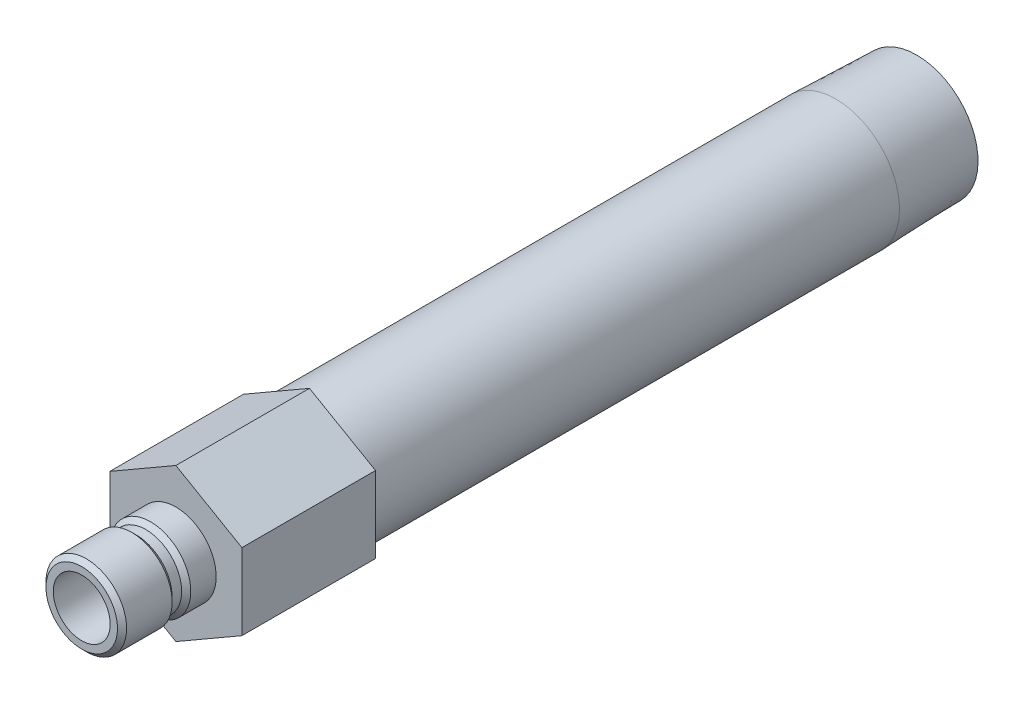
ISO-10303-21;
HEADER;
FILE_DESCRIPTION(('STEP AP214'),'2;1');
FILE_NAME('part.step','',(''),(''),'','','');
FILE_SCHEMA(('AUTOMOTIVE_DESIGN { 1 0 10303 214 1 1 1 1 }'));
ENDSEC;
DATA;
#1=APPLICATION_CONTEXT('core data for automotive mechanical design processes');
#2=APPLICATION_PROTOCOL_DEFINITION('international standard','automotive_design',2000,#1);
#3=PRODUCT_CONTEXT('',#1,'mechanical');
#4=PRODUCT('Part','Part','',(#3));
#5=PRODUCT_RELATED_PRODUCT_CATEGORY('part','',(#4));
#6=PRODUCT_DEFINITION_FORMATION('','',#4);
#7=PRODUCT_DEFINITION_CONTEXT('part definition',#1,'design');
#8=PRODUCT_DEFINITION('design','',#6,#7);
#9=PRODUCT_DEFINITION_SHAPE('','',#8);
#10=(LENGTH_UNIT() NAMED_UNIT(*) SI_UNIT(.MILLI.,.METRE.));
#11=(NAMED_UNIT(*) PLANE_ANGLE_UNIT() SI_UNIT($,.RADIAN.));
#12=(NAMED_UNIT(*) SI_UNIT($,.STERADIAN.) SOLID_ANGLE_UNIT());
#13=UNCERTAINTY_MEASURE_WITH_UNIT(LENGTH_MEASURE(1.E-05),#10,'distance_accuracy_value','');
#14=(GEOMETRIC_REPRESENTATION_CONTEXT(3) GLOBAL_UNCERTAINTY_ASSIGNED_CONTEXT((#13)) GLOBAL_UNIT_ASSIGNED_CONTEXT((#10,
#11,#12)) REPRESENTATION_CONTEXT('',''));
#15=CARTESIAN_POINT('',(0.,0.,0.));
#16=DIRECTION('',(0.,0.,1.));
#17=DIRECTION('',(1.,0.,0.));
#18=AXIS2_PLACEMENT_3D('',#15,#16,#17);
#19=CARTESIAN_POINT('',(0.,0.,0.));
#20=DIRECTION('',(0.,0.,-1.));
#21=DIRECTION('',(0.,1.,0.));
#22=AXIS2_PLACEMENT_3D('',#19,#20,#21);
#23=CYLINDRICAL_SURFACE('',#22,10.668);
#24=CARTESIAN_POINT('',(0.,0.,-110.3884));
#25=DIRECTION('',(0.,0.,-1.));
#26=DIRECTION('',(0.,1.,0.));
#27=AXIS2_PLACEMENT_3D('',#24,#25,#26);
#28=CIRCLE('',#27,10.668);
#29=CARTESIAN_POINT('',(0.,10.668,-110.3884));
#30=VERTEX_POINT('',#29);
#31=EDGE_CURVE('E168',#30,#30,#28,.T.);
#32=ORIENTED_EDGE('',*,*,#31,.F.);
#33=EDGE_LOOP('',(#32));
#34=FACE_BOUND('',#33,.T.);
#35=CARTESIAN_POINT('',(0.,0.,-22.352));
#36=DIRECTION('',(0.,0.,1.));
#37=DIRECTION('',(1.,0.,0.));
#38=AXIS2_PLACEMENT_3D('',#35,#36,#37);
#39=CIRCLE('',#38,10.668);
#40=CARTESIAN_POINT('',(10.668,0.,-22.352));
#41=VERTEX_POINT('',#40);
#42=EDGE_CURVE('E37',#41,#41,#39,.F.);
#43=ORIENTED_EDGE('',*,*,#42,.T.);
#44=EDGE_LOOP('',(#43));
#45=FACE_BOUND('',#44,.T.);
#46=ADVANCED_FACE('F33',(#34,#45),#23,.T.);
#47=CARTESIAN_POINT('',(0.,0.,0.));
#48=DIRECTION('',(0.,0.,-1.));
#49=DIRECTION('',(0.,1.,0.));
#50=AXIS2_PLACEMENT_3D('',#47,#48,#49);
#51=CYLINDRICAL_SURFACE('',#50,4.76249999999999);
#52=CARTESIAN_POINT('',(0.,0.,15.748));
#53=DIRECTION('',(0.,0.,-1.));
#54=DIRECTION('',(0.,1.,0.));
#55=AXIS2_PLACEMENT_3D('',#52,#53,#54);
#56=CIRCLE('',#55,4.7625);
#57=CARTESIAN_POINT('',(0.,4.7625,15.748));
#58=VERTEX_POINT('',#57);
#59=EDGE_CURVE('E144',#58,#58,#56,.T.);
#60=ORIENTED_EDGE('',*,*,#59,.F.);
#61=EDGE_LOOP('',(#60));
#62=FACE_BOUND('',#61,.T.);
#63=CARTESIAN_POINT('',(0.,0.,-22.352));
#64=DIRECTION('',(0.,0.,-1.));
#65=DIRECTION('',(0.,1.,0.));
#66=AXIS2_PLACEMENT_3D('',#63,#64,#65);
#67=CIRCLE('',#66,4.76249999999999);
#68=CARTESIAN_POINT('',(0.,4.7625,-22.352));
#69=VERTEX_POINT('',#68);
#70=EDGE_CURVE('E11',#69,#69,#67,.T.);
#71=ORIENTED_EDGE('',*,*,#70,.T.);
#72=EDGE_LOOP('',(#71));
#73=FACE_BOUND('',#72,.T.);
#74=ADVANCED_FACE('F35',(#62,#73),#51,.F.);
#75=CARTESIAN_POINT('',(0.,4.7625,-22.352));
#76=DIRECTION('',(0.,0.,-1.));
#77=DIRECTION('',(0.,1.,0.));
#78=AXIS2_PLACEMENT_3D('',#75,#76,#77);
#79=PLANE('',#78);
#80=CARTESIAN_POINT('',(0.,0.,-22.352));
#81=DIRECTION('',(0.,0.,-1.));
#82=DIRECTION('',(0.,1.,0.));
#83=AXIS2_PLACEMENT_3D('',#80,#81,#82);
#84=CIRCLE('',#83,7.89939999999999);
#85=CARTESIAN_POINT('',(0.,7.8994,-22.352));
#86=VERTEX_POINT('',#85);
#87=EDGE_CURVE('E43',#86,#86,#84,.T.);
#88=ORIENTED_EDGE('',*,*,#87,.T.);
#89=EDGE_LOOP('',(#88));
#90=FACE_BOUND('',#89,.T.);
#91=ORIENTED_EDGE('',*,*,#70,.F.);
#92=EDGE_LOOP('',(#91));
#93=FACE_BOUND('',#92,.T.);
#94=ADVANCED_FACE('F180',(#90,#93),#79,.T.);
#95=CARTESIAN_POINT('',(0.,0.,0.));
#96=DIRECTION('',(0.,0.,-1.));
#97=DIRECTION('',(0.,1.,0.));
#98=AXIS2_PLACEMENT_3D('',#95,#96,#97);
#99=CYLINDRICAL_SURFACE('',#98,7.89939999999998);
#100=CARTESIAN_POINT('',(0.,0.,-123.952));
#101=DIRECTION('',(0.,0.,-1.));
#102=DIRECTION('',(0.,1.,0.));
#103=AXIS2_PLACEMENT_3D('',#100,#101,#102);
#104=CIRCLE('',#103,7.89939999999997);
#105=CARTESIAN_POINT('',(0.,7.8994,-123.952));
#106=VERTEX_POINT('',#105);
#107=EDGE_CURVE('E174',#106,#106,#104,.T.);
#108=ORIENTED_EDGE('',*,*,#107,.T.);
#109=EDGE_LOOP('',(#108));
#110=FACE_BOUND('',#109,.T.);
#111=ORIENTED_EDGE('',*,*,#87,.F.);
#112=EDGE_LOOP('',(#111));
#113=FACE_BOUND('',#112,.T.);
#114=ADVANCED_FACE('F183',(#110,#113),#99,.F.);
#115=CARTESIAN_POINT('',(0.,10.244140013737,-123.952));
#116=DIRECTION('',(0.,0.,-1.));
#117=DIRECTION('',(0.,1.,0.));
#118=AXIS2_PLACEMENT_3D('',#115,#116,#117);
#119=PLANE('',#118);
#120=CARTESIAN_POINT('',(0.,0.,-123.952));
#121=DIRECTION('',(0.,0.,-1.));
#122=DIRECTION('',(0.,1.,0.));
#123=AXIS2_PLACEMENT_3D('',#120,#121,#122);
#124=CIRCLE('',#123,10.2441400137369);
#125=CARTESIAN_POINT('',(0.,10.244140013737,-123.952));
#126=VERTEX_POINT('',#125);
#127=EDGE_CURVE('E171',#126,#126,#124,.T.);
#128=ORIENTED_EDGE('',*,*,#127,.T.);
#129=EDGE_LOOP('',(#128));
#130=FACE_BOUND('',#129,.T.);
#131=ORIENTED_EDGE('',*,*,#107,.F.);
#132=EDGE_LOOP('',(#131));
#133=FACE_BOUND('',#132,.T.);
#134=ADVANCED_FACE('F185',(#130,#133),#119,.T.);
#135=CARTESIAN_POINT('',(0.,0.,-123.952));
#136=DIRECTION('',(0.,0.,1.));
#137=DIRECTION('',(0.,-1.,0.));
#138=AXIS2_PLACEMENT_3D('',#135,#136,#137);
#139=CONICAL_SURFACE('',#138,10.2441400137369,0.0312396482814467);
#140=ORIENTED_EDGE('',*,*,#31,.T.);
#141=EDGE_LOOP('',(#140));
#142=FACE_BOUND('',#141,.T.);
#143=ORIENTED_EDGE('',*,*,#127,.F.);
#144=EDGE_LOOP('',(#143));
#145=FACE_BOUND('',#144,.T.);
#146=ADVANCED_FACE('F192',(#142,#145),#139,.T.);
#147=CARTESIAN_POINT('',(0.,6.7437,0.));
#148=DIRECTION('',(0.,0.,1.));
#149=DIRECTION('',(0.,-1.,0.));
#150=AXIS2_PLACEMENT_3D('',#147,#148,#149);
#151=PLANE('',#150);
#152=CARTESIAN_POINT('',(0.,0.,0.));
#153=DIRECTION('',(0.,0.,-1.));
#154=DIRECTION('',(0.,1.,0.));
#155=AXIS2_PLACEMENT_3D('',#152,#153,#154);
#156=CIRCLE('',#155,6.7437);
#157=CARTESIAN_POINT('',(0.,6.7437,0.));
#158=VERTEX_POINT('',#157);
#159=EDGE_CURVE('E165',#158,#158,#156,.T.);
#160=ORIENTED_EDGE('',*,*,#159,.T.);
#161=EDGE_LOOP('',(#160));
#162=FACE_BOUND('',#161,.T.);
#163=DIRECTION('',(-0.866025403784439,-0.5,0.));
#164=VECTOR('',#163,1.);
#165=CARTESIAN_POINT('',(0.,12.7582862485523,0.));
#166=LINE('',#165,#164);
#167=CARTESIAN_POINT('',(0.,12.7582862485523,0.));
#168=VERTEX_POINT('',#167);
#169=CARTESIAN_POINT('',(-11.049,6.37914312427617,0.));
#170=VERTEX_POINT('',#169);
#171=EDGE_CURVE('E122',#168,#170,#166,.T.);
#172=ORIENTED_EDGE('',*,*,#171,.T.);
#173=DIRECTION('',(0.,-1.,0.));
#174=VECTOR('',#173,1.);
#175=CARTESIAN_POINT('',(-11.049,6.37914312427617,0.));
#176=LINE('',#175,#174);
#177=CARTESIAN_POINT('',(-11.049,-6.37914312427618,0.));
#178=VERTEX_POINT('',#177);
#179=EDGE_CURVE('E125',#170,#178,#176,.T.);
#180=ORIENTED_EDGE('',*,*,#179,.T.);
#181=DIRECTION('',(0.866025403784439,-0.5,0.));
#182=VECTOR('',#181,1.);
#183=CARTESIAN_POINT('',(-11.049,-6.37914312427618,0.));
#184=LINE('',#183,#182);
#185=CARTESIAN_POINT('',(0.,-12.7582862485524,0.));
#186=VERTEX_POINT('',#185);
#187=EDGE_CURVE('E128',#178,#186,#184,.T.);
#188=ORIENTED_EDGE('',*,*,#187,.T.);
#189=DIRECTION('',(0.866025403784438,0.5,0.));
#190=VECTOR('',#189,1.);
#191=CARTESIAN_POINT('',(0.,-12.7582862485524,0.));
#192=LINE('',#191,#190);
#193=CARTESIAN_POINT('',(11.049,-6.37914312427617,0.));
#194=VERTEX_POINT('',#193);
#195=EDGE_CURVE('E131',#186,#194,#192,.T.);
#196=ORIENTED_EDGE('',*,*,#195,.T.);
#197=DIRECTION('',(0.,1.,0.));
#198=VECTOR('',#197,1.);
#199=CARTESIAN_POINT('',(11.049,-6.37914312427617,0.));
#200=LINE('',#199,#198);
#201=CARTESIAN_POINT('',(11.049,6.37914312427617,0.));
#202=VERTEX_POINT('',#201);
#203=EDGE_CURVE('E99',#194,#202,#200,.T.);
#204=ORIENTED_EDGE('',*,*,#203,.T.);
#205=DIRECTION('',(-0.866025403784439,0.5,0.));
#206=VECTOR('',#205,1.);
#207=CARTESIAN_POINT('',(11.049,6.37914312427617,0.));
#208=LINE('',#207,#206);
#209=EDGE_CURVE('E134',#202,#168,#208,.T.);
#210=ORIENTED_EDGE('',*,*,#209,.T.);
#211=EDGE_LOOP('',(#172,#180,#188,#196,#204,#210));
#212=FACE_BOUND('',#211,.T.);
#213=ADVANCED_FACE('F206',(#162,#212),#151,.T.);
#214=CARTESIAN_POINT('',(0.,0.,0.));
#215=DIRECTION('',(0.,0.,-1.));
#216=DIRECTION('',(0.,1.,0.));
#217=AXIS2_PLACEMENT_3D('',#214,#215,#216);
#218=CYLINDRICAL_SURFACE('',#217,6.7437);
#219=CARTESIAN_POINT('',(0.,0.,4.25449999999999));
#220=DIRECTION('',(0.,0.,-1.));
#221=DIRECTION('',(0.,1.,0.));
#222=AXIS2_PLACEMENT_3D('',#219,#220,#221);
#223=CIRCLE('',#222,6.7437);
#224=CARTESIAN_POINT('',(0.,6.7437,4.25449999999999));
#225=VERTEX_POINT('',#224);
#226=EDGE_CURVE('E162',#225,#225,#223,.T.);
#227=ORIENTED_EDGE('',*,*,#226,.T.);
#228=EDGE_LOOP('',(#227));
#229=FACE_BOUND('',#228,.T.);
#230=ORIENTED_EDGE('',*,*,#159,.F.);
#231=EDGE_LOOP('',(#230));
#232=FACE_BOUND('',#231,.T.);
#233=ADVANCED_FACE('F213',(#229,#232),#218,.T.);
#234=CARTESIAN_POINT('',(0.,0.,4.25449999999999));
#235=DIRECTION('',(0.,0.,-1.));
#236=DIRECTION('',(0.,1.,0.));
#237=AXIS2_PLACEMENT_3D('',#234,#235,#236);
#238=CONICAL_SURFACE('',#237,6.7437,0.785398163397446);
#239=CARTESIAN_POINT('',(0.,0.,5.0165));
#240=DIRECTION('',(0.,0.,-1.));
#241=DIRECTION('',(0.,1.,0.));
#242=AXIS2_PLACEMENT_3D('',#239,#240,#241);
#243=CIRCLE('',#242,5.9817);
#244=CARTESIAN_POINT('',(0.,5.9817,5.0165));
#245=VERTEX_POINT('',#244);
#246=EDGE_CURVE('E159',#245,#245,#243,.T.);
#247=ORIENTED_EDGE('',*,*,#246,.T.);
#248=EDGE_LOOP('',(#247));
#249=FACE_BOUND('',#248,.T.);
#250=ORIENTED_EDGE('',*,*,#226,.F.);
#251=EDGE_LOOP('',(#250));
#252=FACE_BOUND('',#251,.T.);
#253=ADVANCED_FACE('F222',(#249,#252),#238,.T.);
#254=CARTESIAN_POINT('',(0.,0.,0.));
#255=DIRECTION('',(0.,0.,-1.));
#256=DIRECTION('',(0.,1.,0.));
#257=AXIS2_PLACEMENT_3D('',#254,#255,#256);
#258=CYLINDRICAL_SURFACE('',#257,5.9817);
#259=CARTESIAN_POINT('',(0.,0.,6.604));
#260=DIRECTION('',(0.,0.,-1.));
#261=DIRECTION('',(0.,1.,0.));
#262=AXIS2_PLACEMENT_3D('',#259,#260,#261);
#263=CIRCLE('',#262,5.9817);
#264=CARTESIAN_POINT('',(0.,5.9817,6.604));
#265=VERTEX_POINT('',#264);
#266=EDGE_CURVE('E156',#265,#265,#263,.T.);
#267=ORIENTED_EDGE('',*,*,#266,.T.);
#268=EDGE_LOOP('',(#267));
#269=FACE_BOUND('',#268,.T.);
#270=ORIENTED_EDGE('',*,*,#246,.F.);
#271=EDGE_LOOP('',(#270));
#272=FACE_BOUND('',#271,.T.);
#273=ADVANCED_FACE('F263',(#269,#272),#258,.T.);
#274=CARTESIAN_POINT('',(0.,0.,6.604));
#275=DIRECTION('',(0.,0.,1.));
#276=DIRECTION('',(0.,-1.,0.));
#277=AXIS2_PLACEMENT_3D('',#274,#275,#276);
#278=CONICAL_SURFACE('',#277,5.9817,0.785398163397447);
#279=CARTESIAN_POINT('',(0.,0.,7.366));
#280=DIRECTION('',(0.,0.,-1.));
#281=DIRECTION('',(0.,1.,0.));
#282=AXIS2_PLACEMENT_3D('',#279,#280,#281);
#283=CIRCLE('',#282,6.7437);
#284=CARTESIAN_POINT('',(0.,6.7437,7.366));
#285=VERTEX_POINT('',#284);
#286=EDGE_CURVE('E153',#285,#285,#283,.T.);
#287=ORIENTED_EDGE('',*,*,#286,.T.);
#288=EDGE_LOOP('',(#287));
#289=FACE_BOUND('',#288,.T.);
#290=ORIENTED_EDGE('',*,*,#266,.F.);
#291=EDGE_LOOP('',(#290));
#292=FACE_BOUND('',#291,.T.);
#293=ADVANCED_FACE('F259',(#289,#292),#278,.T.);
#294=CARTESIAN_POINT('',(0.,0.,0.));
#295=DIRECTION('',(0.,0.,-1.));
#296=DIRECTION('',(0.,1.,0.));
#297=AXIS2_PLACEMENT_3D('',#294,#295,#296);
#298=CYLINDRICAL_SURFACE('',#297,6.7437);
#299=CARTESIAN_POINT('',(0.,0.,14.986));
#300=DIRECTION('',(0.,0.,-1.));
#301=DIRECTION('',(0.,1.,0.));
#302=AXIS2_PLACEMENT_3D('',#299,#300,#301);
#303=CIRCLE('',#302,6.7437);
#304=CARTESIAN_POINT('',(0.,6.7437,14.986));
#305=VERTEX_POINT('',#304);
#306=EDGE_CURVE('E150',#305,#305,#303,.T.);
#307=ORIENTED_EDGE('',*,*,#306,.T.);
#308=EDGE_LOOP('',(#307));
#309=FACE_BOUND('',#308,.T.);
#310=ORIENTED_EDGE('',*,*,#286,.F.);
#311=EDGE_LOOP('',(#310));
#312=FACE_BOUND('',#311,.T.);
#313=ADVANCED_FACE('F255',(#309,#312),#298,.T.);
#314=CARTESIAN_POINT('',(0.,0.,14.986));
#315=DIRECTION('',(0.,0.,-1.));
#316=DIRECTION('',(0.,1.,0.));
#317=AXIS2_PLACEMENT_3D('',#314,#315,#316);
#318=CONICAL_SURFACE('',#317,6.7437,0.785398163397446);
#319=CARTESIAN_POINT('',(0.,0.,15.748));
#320=DIRECTION('',(0.,0.,-1.));
#321=DIRECTION('',(0.,1.,0.));
#322=AXIS2_PLACEMENT_3D('',#319,#320,#321);
#323=CIRCLE('',#322,5.9817);
#324=CARTESIAN_POINT('',(0.,5.9817,15.748));
#325=VERTEX_POINT('',#324);
#326=EDGE_CURVE('E147',#325,#325,#323,.T.);
#327=ORIENTED_EDGE('',*,*,#326,.T.);
#328=EDGE_LOOP('',(#327));
#329=FACE_BOUND('',#328,.T.);
#330=ORIENTED_EDGE('',*,*,#306,.F.);
#331=EDGE_LOOP('',(#330));
#332=FACE_BOUND('',#331,.T.);
#333=ADVANCED_FACE('F251',(#329,#332),#318,.T.);
#334=CARTESIAN_POINT('',(0.,4.7625,15.748));
#335=DIRECTION('',(0.,0.,1.));
#336=DIRECTION('',(0.,-1.,0.));
#337=AXIS2_PLACEMENT_3D('',#334,#335,#336);
#338=PLANE('',#337);
#339=ORIENTED_EDGE('',*,*,#59,.T.);
#340=EDGE_LOOP('',(#339));
#341=FACE_BOUND('',#340,.T.);
#342=ORIENTED_EDGE('',*,*,#326,.F.);
#343=EDGE_LOOP('',(#342));
#344=FACE_BOUND('',#343,.T.);
#345=ADVANCED_FACE('F239',(#341,#344),#338,.T.);
#346=CARTESIAN_POINT('',(0.,12.7582862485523,-22.352));
#347=DIRECTION('',(-0.5,0.866025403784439,0.));
#348=DIRECTION('',(-0.866025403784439,-0.5,0.));
#349=AXIS2_PLACEMENT_3D('',#346,#347,#348);
#350=PLANE('',#349);
#351=ORIENTED_EDGE('',*,*,#171,.F.);
#352=DIRECTION('',(0.,0.,1.));
#353=VECTOR('',#352,1.);
#354=CARTESIAN_POINT('',(0.,12.7582862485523,-22.352));
#355=LINE('',#354,#353);
#356=CARTESIAN_POINT('',(0.,12.7582862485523,-22.352));
#357=VERTEX_POINT('',#356);
#358=EDGE_CURVE('E51',#357,#168,#355,.T.);
#359=ORIENTED_EDGE('',*,*,#358,.F.);
#360=DIRECTION('',(-0.866025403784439,-0.5,0.));
#361=VECTOR('',#360,1.);
#362=CARTESIAN_POINT('',(0.,12.7582862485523,-22.352));
#363=LINE('',#362,#361);
#364=CARTESIAN_POINT('',(-11.049,6.37914312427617,-22.352));
#365=VERTEX_POINT('',#364);
#366=EDGE_CURVE('E137',#357,#365,#363,.T.);
#367=ORIENTED_EDGE('',*,*,#366,.T.);
#368=DIRECTION('',(0.,0.,1.));
#369=VECTOR('',#368,1.);
#370=CARTESIAN_POINT('',(-11.049,6.37914312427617,-22.352));
#371=LINE('',#370,#369);
#372=EDGE_CURVE('E86',#365,#170,#371,.T.);
#373=ORIENTED_EDGE('',*,*,#372,.T.);
#374=EDGE_LOOP('',(#351,#359,#367,#373));
#375=FACE_BOUND('',#374,.T.);
#376=ADVANCED_FACE('F226',(#375),#350,.T.);
#377=CARTESIAN_POINT('',(11.049,6.37914312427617,-22.352));
#378=DIRECTION('',(0.5,0.866025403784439,0.));
#379=DIRECTION('',(-0.866025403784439,0.5,0.));
#380=AXIS2_PLACEMENT_3D('',#377,#378,#379);
#381=PLANE('',#380);
#382=ORIENTED_EDGE('',*,*,#209,.F.);
#383=DIRECTION('',(0.,0.,1.));
#384=VECTOR('',#383,1.);
#385=CARTESIAN_POINT('',(11.049,6.37914312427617,-22.352));
#386=LINE('',#385,#384);
#387=CARTESIAN_POINT('',(11.049,6.37914312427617,-22.352));
#388=VERTEX_POINT('',#387);
#389=EDGE_CURVE('E74',#388,#202,#386,.T.);
#390=ORIENTED_EDGE('',*,*,#389,.F.);
#391=DIRECTION('',(-0.866025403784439,0.5,0.));
#392=VECTOR('',#391,1.);
#393=CARTESIAN_POINT('',(11.049,6.37914312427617,-22.352));
#394=LINE('',#393,#392);
#395=EDGE_CURVE('E112',#388,#357,#394,.T.);
#396=ORIENTED_EDGE('',*,*,#395,.T.);
#397=ORIENTED_EDGE('',*,*,#358,.T.);
#398=EDGE_LOOP('',(#382,#390,#396,#397));
#399=FACE_BOUND('',#398,.T.);
#400=ADVANCED_FACE('F231',(#399),#381,.T.);
#401=CARTESIAN_POINT('',(11.049,-6.37914312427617,-22.352));
#402=DIRECTION('',(1.,0.,0.));
#403=DIRECTION('',(0.,0.,-1.));
#404=AXIS2_PLACEMENT_3D('',#401,#402,#403);
#405=PLANE('',#404);
#406=ORIENTED_EDGE('',*,*,#203,.F.);
#407=DIRECTION('',(0.,0.,1.));
#408=VECTOR('',#407,1.);
#409=CARTESIAN_POINT('',(11.049,-6.37914312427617,-22.352));
#410=LINE('',#409,#408);
#411=CARTESIAN_POINT('',(11.049,-6.37914312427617,-22.352));
#412=VERTEX_POINT('',#411);
#413=EDGE_CURVE('E94',#412,#194,#410,.T.);
#414=ORIENTED_EDGE('',*,*,#413,.F.);
#415=DIRECTION('',(0.,1.,0.));
#416=VECTOR('',#415,1.);
#417=CARTESIAN_POINT('',(11.049,-6.37914312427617,-22.352));
#418=LINE('',#417,#416);
#419=EDGE_CURVE('E97',#412,#388,#418,.T.);
#420=ORIENTED_EDGE('',*,*,#419,.T.);
#421=ORIENTED_EDGE('',*,*,#389,.T.);
#422=EDGE_LOOP('',(#406,#414,#420,#421));
#423=FACE_BOUND('',#422,.T.);
#424=ADVANCED_FACE('F96',(#423),#405,.T.);
#425=CARTESIAN_POINT('',(0.,-12.7582862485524,-22.352));
#426=DIRECTION('',(0.5,-0.866025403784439,0.));
#427=DIRECTION('',(0.866025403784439,0.5,0.));
#428=AXIS2_PLACEMENT_3D('',#425,#426,#427);
#429=PLANE('',#428);
#430=ORIENTED_EDGE('',*,*,#195,.F.);
#431=DIRECTION('',(0.,0.,1.));
#432=VECTOR('',#431,1.);
#433=CARTESIAN_POINT('',(0.,-12.7582862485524,-22.352));
#434=LINE('',#433,#432);
#435=CARTESIAN_POINT('',(0.,-12.7582862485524,-22.352));
#436=VERTEX_POINT('',#435);
#437=EDGE_CURVE('E104',#436,#186,#434,.T.);
#438=ORIENTED_EDGE('',*,*,#437,.F.);
#439=DIRECTION('',(0.866025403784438,0.5,0.));
#440=VECTOR('',#439,1.);
#441=CARTESIAN_POINT('',(0.,-12.7582862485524,-22.352));
#442=LINE('',#441,#440);
#443=EDGE_CURVE('E110',#436,#412,#442,.T.);
#444=ORIENTED_EDGE('',*,*,#443,.T.);
#445=ORIENTED_EDGE('',*,*,#413,.T.);
#446=EDGE_LOOP('',(#430,#438,#444,#445));
#447=FACE_BOUND('',#446,.T.);
#448=ADVANCED_FACE('F114',(#447),#429,.T.);
#449=CARTESIAN_POINT('',(-11.049,-6.37914312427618,-22.352));
#450=DIRECTION('',(-0.5,-0.866025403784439,0.));
#451=DIRECTION('',(0.866025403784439,-0.5,0.));
#452=AXIS2_PLACEMENT_3D('',#449,#450,#451);
#453=PLANE('',#452);
#454=ORIENTED_EDGE('',*,*,#187,.F.);
#455=DIRECTION('',(0.,0.,1.));
#456=VECTOR('',#455,1.);
#457=CARTESIAN_POINT('',(-11.049,-6.37914312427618,-22.352));
#458=LINE('',#457,#456);
#459=CARTESIAN_POINT('',(-11.049,-6.37914312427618,-22.352));
#460=VERTEX_POINT('',#459);
#461=EDGE_CURVE('E141',#460,#178,#458,.T.);
#462=ORIENTED_EDGE('',*,*,#461,.F.);
#463=DIRECTION('',(0.866025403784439,-0.5,0.));
#464=VECTOR('',#463,1.);
#465=CARTESIAN_POINT('',(-11.049,-6.37914312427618,-22.352));
#466=LINE('',#465,#464);
#467=EDGE_CURVE('E115',#460,#436,#466,.T.);
#468=ORIENTED_EDGE('',*,*,#467,.T.);
#469=ORIENTED_EDGE('',*,*,#437,.T.);
#470=EDGE_LOOP('',(#454,#462,#468,#469));
#471=FACE_BOUND('',#470,.T.);
#472=ADVANCED_FACE('F230',(#471),#453,.T.);
#473=CARTESIAN_POINT('',(-11.049,6.37914312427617,-22.352));
#474=DIRECTION('',(-1.,0.,0.));
#475=DIRECTION('',(0.,0.,1.));
#476=AXIS2_PLACEMENT_3D('',#473,#474,#475);
#477=PLANE('',#476);
#478=ORIENTED_EDGE('',*,*,#179,.F.);
#479=ORIENTED_EDGE('',*,*,#372,.F.);
#480=DIRECTION('',(0.,-1.,0.));
#481=VECTOR('',#480,1.);
#482=CARTESIAN_POINT('',(-11.049,6.37914312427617,-22.352));
#483=LINE('',#482,#481);
#484=EDGE_CURVE('E117',#365,#460,#483,.T.);
#485=ORIENTED_EDGE('',*,*,#484,.T.);
#486=ORIENTED_EDGE('',*,*,#461,.T.);
#487=EDGE_LOOP('',(#478,#479,#485,#486));
#488=FACE_BOUND('',#487,.T.);
#489=ADVANCED_FACE('F227',(#488),#477,.T.);
#490=CARTESIAN_POINT('',(-11.049,6.37914312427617,-22.352));
#491=DIRECTION('',(0.,0.,1.));
#492=DIRECTION('',(1.,0.,0.));
#493=AXIS2_PLACEMENT_3D('',#490,#491,#492);
#494=PLANE('',#493);
#495=ORIENTED_EDGE('',*,*,#42,.F.);
#496=EDGE_LOOP('',(#495));
#497=FACE_BOUND('',#496,.T.);
#498=ORIENTED_EDGE('',*,*,#366,.F.);
#499=ORIENTED_EDGE('',*,*,#395,.F.);
#500=ORIENTED_EDGE('',*,*,#419,.F.);
#501=ORIENTED_EDGE('',*,*,#443,.F.);
#502=ORIENTED_EDGE('',*,*,#467,.F.);
#503=ORIENTED_EDGE('',*,*,#484,.F.);
#504=EDGE_LOOP('',(#498,#499,#500,#501,#502,#503));
#505=FACE_BOUND('',#504,.T.);
#506=ADVANCED_FACE('F108',(#497,#505),#494,.F.);
#507=CLOSED_SHELL('',(#46,#74,#94,#114,#134,#146,#213,#233,#253,#273,#293,#313,#333,#345,#376,
#400,#424,#448,#472,#489,#506));
#508=MANIFOLD_SOLID_BREP('B2',#507);
#509=ADVANCED_BREP_SHAPE_REPRESENTATION('',(#18,#508),#14);
#510=SHAPE_DEFINITION_REPRESENTATION(#9,#509);
ENDSEC;
END-ISO-10303-21;
